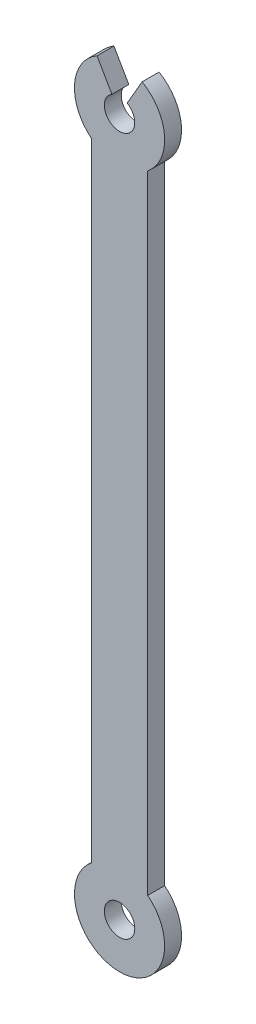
ISO-10303-21;
HEADER;
FILE_DESCRIPTION(('STEP AP214'),'2;1');
FILE_NAME('part.step','',(''),(''),'','','');
FILE_SCHEMA(('AUTOMOTIVE_DESIGN { 1 0 10303 214 1 1 1 1 }'));
ENDSEC;
DATA;
#1=APPLICATION_CONTEXT('core data for automotive mechanical design processes');
#2=APPLICATION_PROTOCOL_DEFINITION('international standard','automotive_design',2000,#1);
#3=PRODUCT_CONTEXT('',#1,'mechanical');
#4=PRODUCT('Part','Part','',(#3));
#5=PRODUCT_RELATED_PRODUCT_CATEGORY('part','',(#4));
#6=PRODUCT_DEFINITION_FORMATION('','',#4);
#7=PRODUCT_DEFINITION_CONTEXT('part definition',#1,'design');
#8=PRODUCT_DEFINITION('design','',#6,#7);
#9=PRODUCT_DEFINITION_SHAPE('','',#8);
#10=(LENGTH_UNIT() NAMED_UNIT(*) SI_UNIT(.MILLI.,.METRE.));
#11=(NAMED_UNIT(*) PLANE_ANGLE_UNIT() SI_UNIT($,.RADIAN.));
#12=(NAMED_UNIT(*) SI_UNIT($,.STERADIAN.) SOLID_ANGLE_UNIT());
#13=UNCERTAINTY_MEASURE_WITH_UNIT(LENGTH_MEASURE(1.E-05),#10,'distance_accuracy_value','');
#14=(GEOMETRIC_REPRESENTATION_CONTEXT(3) GLOBAL_UNCERTAINTY_ASSIGNED_CONTEXT((#13)) GLOBAL_UNIT_ASSIGNED_CONTEXT((#10,
#11,#12)) REPRESENTATION_CONTEXT('',''));
#15=CARTESIAN_POINT('',(0.,0.,0.));
#16=DIRECTION('',(0.,0.,1.));
#17=DIRECTION('',(1.,0.,0.));
#18=AXIS2_PLACEMENT_3D('',#15,#16,#17);
#19=CARTESIAN_POINT('',(0.,0.,1.5));
#20=DIRECTION('',(-0.866025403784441,-0.499999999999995,0.));
#21=DIRECTION('',(0.499999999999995,-0.866025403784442,0.));
#22=AXIS2_PLACEMENT_3D('',#19,#20,#21);
#23=PLANE('',#22);
#24=DIRECTION('',(-0.499999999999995,0.866025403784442,0.));
#25=VECTOR('',#24,1.);
#26=CARTESIAN_POINT('',(0.,0.,0.));
#27=LINE('',#26,#25);
#28=CARTESIAN_POINT('',(-0.674999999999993,1.169134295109,0.));
#29=VERTEX_POINT('',#28);
#30=CARTESIAN_POINT('',(-1.99999999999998,3.46410161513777,0.));
#31=VERTEX_POINT('',#30);
#32=EDGE_CURVE('E147',#29,#31,#27,.T.);
#33=ORIENTED_EDGE('',*,*,#32,.T.);
#34=DIRECTION('',(0.,0.,-1.));
#35=VECTOR('',#34,1.);
#36=CARTESIAN_POINT('',(-1.99999999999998,3.46410161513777,1.5));
#37=LINE('',#36,#35);
#38=CARTESIAN_POINT('',(-1.99999999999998,3.46410161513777,1.5));
#39=VERTEX_POINT('',#38);
#40=EDGE_CURVE('E11',#39,#31,#37,.T.);
#41=ORIENTED_EDGE('',*,*,#40,.F.);
#42=DIRECTION('',(-0.499999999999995,0.866025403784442,0.));
#43=VECTOR('',#42,1.);
#44=CARTESIAN_POINT('',(0.,0.,1.5));
#45=LINE('',#44,#43);
#46=CARTESIAN_POINT('',(-0.674999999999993,1.169134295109,1.5));
#47=VERTEX_POINT('',#46);
#48=EDGE_CURVE('E210',#47,#39,#45,.T.);
#49=ORIENTED_EDGE('',*,*,#48,.F.);
#50=DIRECTION('',(0.,0.,-1.));
#51=VECTOR('',#50,1.);
#52=CARTESIAN_POINT('',(-0.674999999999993,1.169134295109,1.5));
#53=LINE('',#52,#51);
#54=EDGE_CURVE('E59',#47,#29,#53,.T.);
#55=ORIENTED_EDGE('',*,*,#54,.T.);
#56=EDGE_LOOP('',(#33,#41,#49,#55));
#57=FACE_BOUND('',#56,.T.);
#58=ADVANCED_FACE('F41',(#57),#23,.F.);
#59=CARTESIAN_POINT('',(0.,0.,1.5));
#60=DIRECTION('',(0.,0.,-1.));
#61=DIRECTION('',(-1.,0.,0.));
#62=AXIS2_PLACEMENT_3D('',#59,#60,#61);
#63=CYLINDRICAL_SURFACE('',#62,4.);
#64=CARTESIAN_POINT('',(0.,0.,0.));
#65=DIRECTION('',(0.,0.,1.));
#66=DIRECTION('',(1.,0.,0.));
#67=AXIS2_PLACEMENT_3D('',#64,#65,#66);
#68=CIRCLE('',#67,4.);
#69=CARTESIAN_POINT('',(-2.5,-3.1224989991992,0.));
#70=VERTEX_POINT('',#69);
#71=EDGE_CURVE('E150',#31,#70,#68,.T.);
#72=ORIENTED_EDGE('',*,*,#71,.T.);
#73=DIRECTION('',(0.,0.,-1.));
#74=VECTOR('',#73,1.);
#75=CARTESIAN_POINT('',(-2.5,-3.1224989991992,1.5));
#76=LINE('',#75,#74);
#77=CARTESIAN_POINT('',(-2.5,-3.1224989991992,1.5));
#78=VERTEX_POINT('',#77);
#79=EDGE_CURVE('E51',#78,#70,#76,.T.);
#80=ORIENTED_EDGE('',*,*,#79,.F.);
#81=CARTESIAN_POINT('',(0.,0.,1.5));
#82=DIRECTION('',(0.,0.,1.));
#83=DIRECTION('',(1.,0.,0.));
#84=AXIS2_PLACEMENT_3D('',#81,#82,#83);
#85=CIRCLE('',#84,4.);
#86=EDGE_CURVE('E97',#39,#78,#85,.T.);
#87=ORIENTED_EDGE('',*,*,#86,.F.);
#88=ORIENTED_EDGE('',*,*,#40,.T.);
#89=EDGE_LOOP('',(#72,#80,#87,#88));
#90=FACE_BOUND('',#89,.T.);
#91=ADVANCED_FACE('F194',(#90),#63,.T.);
#92=CARTESIAN_POINT('',(-2.5,0.,1.5));
#93=DIRECTION('',(-1.,0.,0.));
#94=DIRECTION('',(0.,-1.,0.));
#95=AXIS2_PLACEMENT_3D('',#92,#93,#94);
#96=PLANE('',#95);
#97=DIRECTION('',(0.,1.,0.));
#98=VECTOR('',#97,1.);
#99=CARTESIAN_POINT('',(-2.5,0.,0.));
#100=LINE('',#99,#98);
#101=CARTESIAN_POINT('',(-2.5,-58.7775010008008,0.));
#102=VERTEX_POINT('',#101);
#103=EDGE_CURVE('E154',#102,#70,#100,.T.);
#104=ORIENTED_EDGE('',*,*,#103,.F.);
#105=DIRECTION('',(0.,0.,-1.));
#106=VECTOR('',#105,1.);
#107=CARTESIAN_POINT('',(-2.5,-58.7775010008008,1.5));
#108=LINE('',#107,#106);
#109=CARTESIAN_POINT('',(-2.5,-58.7775010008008,1.5));
#110=VERTEX_POINT('',#109);
#111=EDGE_CURVE('E185',#110,#102,#108,.T.);
#112=ORIENTED_EDGE('',*,*,#111,.F.);
#113=DIRECTION('',(0.,1.,0.));
#114=VECTOR('',#113,1.);
#115=CARTESIAN_POINT('',(-2.5,0.,1.5));
#116=LINE('',#115,#114);
#117=EDGE_CURVE('E193',#110,#78,#116,.T.);
#118=ORIENTED_EDGE('',*,*,#117,.T.);
#119=ORIENTED_EDGE('',*,*,#79,.T.);
#120=EDGE_LOOP('',(#104,#112,#118,#119));
#121=FACE_BOUND('',#120,.T.);
#122=ADVANCED_FACE('F191',(#121),#96,.T.);
#123=CARTESIAN_POINT('',(0.,-61.9,1.5));
#124=DIRECTION('',(0.,0.,-1.));
#125=DIRECTION('',(-1.,0.,0.));
#126=AXIS2_PLACEMENT_3D('',#123,#124,#125);
#127=CYLINDRICAL_SURFACE('',#126,4.);
#128=CARTESIAN_POINT('',(0.,-61.9,0.));
#129=DIRECTION('',(0.,0.,1.));
#130=DIRECTION('',(1.,0.,0.));
#131=AXIS2_PLACEMENT_3D('',#128,#129,#130);
#132=CIRCLE('',#131,4.);
#133=CARTESIAN_POINT('',(2.50000000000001,-58.7775010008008,0.));
#134=VERTEX_POINT('',#133);
#135=EDGE_CURVE('E158',#102,#134,#132,.T.);
#136=ORIENTED_EDGE('',*,*,#135,.T.);
#137=DIRECTION('',(0.,0.,-1.));
#138=VECTOR('',#137,1.);
#139=CARTESIAN_POINT('',(2.50000000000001,-58.7775010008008,1.5));
#140=LINE('',#139,#138);
#141=CARTESIAN_POINT('',(2.50000000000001,-58.7775010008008,1.5));
#142=VERTEX_POINT('',#141);
#143=EDGE_CURVE('E182',#142,#134,#140,.T.);
#144=ORIENTED_EDGE('',*,*,#143,.F.);
#145=CARTESIAN_POINT('',(0.,-61.9,1.5));
#146=DIRECTION('',(0.,0.,1.));
#147=DIRECTION('',(1.,0.,0.));
#148=AXIS2_PLACEMENT_3D('',#145,#146,#147);
#149=CIRCLE('',#148,4.);
#150=EDGE_CURVE('E204',#110,#142,#149,.T.);
#151=ORIENTED_EDGE('',*,*,#150,.F.);
#152=ORIENTED_EDGE('',*,*,#111,.T.);
#153=EDGE_LOOP('',(#136,#144,#151,#152));
#154=FACE_BOUND('',#153,.T.);
#155=ADVANCED_FACE('F202',(#154),#127,.T.);
#156=CARTESIAN_POINT('',(2.5,0.,1.5));
#157=DIRECTION('',(1.,0.,0.));
#158=DIRECTION('',(0.,1.,0.));
#159=AXIS2_PLACEMENT_3D('',#156,#157,#158);
#160=PLANE('',#159);
#161=DIRECTION('',(0.,-1.,0.));
#162=VECTOR('',#161,1.);
#163=CARTESIAN_POINT('',(2.5,0.,0.));
#164=LINE('',#163,#162);
#165=CARTESIAN_POINT('',(2.5,-3.1224989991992,0.));
#166=VERTEX_POINT('',#165);
#167=EDGE_CURVE('E162',#166,#134,#164,.T.);
#168=ORIENTED_EDGE('',*,*,#167,.F.);
#169=DIRECTION('',(0.,0.,-1.));
#170=VECTOR('',#169,1.);
#171=CARTESIAN_POINT('',(2.5,-3.1224989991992,1.5));
#172=LINE('',#171,#170);
#173=CARTESIAN_POINT('',(2.5,-3.1224989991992,1.5));
#174=VERTEX_POINT('',#173);
#175=EDGE_CURVE('E133',#174,#166,#172,.T.);
#176=ORIENTED_EDGE('',*,*,#175,.F.);
#177=DIRECTION('',(0.,-1.,0.));
#178=VECTOR('',#177,1.);
#179=CARTESIAN_POINT('',(2.5,0.,1.5));
#180=LINE('',#179,#178);
#181=EDGE_CURVE('E121',#174,#142,#180,.T.);
#182=ORIENTED_EDGE('',*,*,#181,.T.);
#183=ORIENTED_EDGE('',*,*,#143,.T.);
#184=EDGE_LOOP('',(#168,#176,#182,#183));
#185=FACE_BOUND('',#184,.T.);
#186=ADVANCED_FACE('F215',(#185),#160,.T.);
#187=CARTESIAN_POINT('',(0.,0.,1.5));
#188=DIRECTION('',(0.,0.,-1.));
#189=DIRECTION('',(-1.,0.,0.));
#190=AXIS2_PLACEMENT_3D('',#187,#188,#189);
#191=CYLINDRICAL_SURFACE('',#190,4.);
#192=CARTESIAN_POINT('',(0.,0.,0.));
#193=DIRECTION('',(0.,0.,1.));
#194=DIRECTION('',(1.,0.,0.));
#195=AXIS2_PLACEMENT_3D('',#192,#193,#194);
#196=CIRCLE('',#195,4.);
#197=CARTESIAN_POINT('',(1.99999999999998,3.46410161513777,0.));
#198=VERTEX_POINT('',#197);
#199=EDGE_CURVE('E129',#166,#198,#196,.T.);
#200=ORIENTED_EDGE('',*,*,#199,.T.);
#201=DIRECTION('',(0.,0.,-1.));
#202=VECTOR('',#201,1.);
#203=CARTESIAN_POINT('',(1.99999999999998,3.46410161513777,1.5));
#204=LINE('',#203,#202);
#205=CARTESIAN_POINT('',(1.99999999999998,3.46410161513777,1.5));
#206=VERTEX_POINT('',#205);
#207=EDGE_CURVE('E126',#206,#198,#204,.T.);
#208=ORIENTED_EDGE('',*,*,#207,.F.);
#209=CARTESIAN_POINT('',(0.,0.,1.5));
#210=DIRECTION('',(0.,0.,1.));
#211=DIRECTION('',(1.,0.,0.));
#212=AXIS2_PLACEMENT_3D('',#209,#210,#211);
#213=CIRCLE('',#212,4.);
#214=EDGE_CURVE('E114',#174,#206,#213,.T.);
#215=ORIENTED_EDGE('',*,*,#214,.F.);
#216=ORIENTED_EDGE('',*,*,#175,.T.);
#217=EDGE_LOOP('',(#200,#208,#215,#216));
#218=FACE_BOUND('',#217,.T.);
#219=ADVANCED_FACE('F127',(#218),#191,.T.);
#220=CARTESIAN_POINT('',(0.,0.,1.5));
#221=DIRECTION('',(-0.866025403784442,0.499999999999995,0.));
#222=DIRECTION('',(-0.499999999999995,-0.866025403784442,0.));
#223=AXIS2_PLACEMENT_3D('',#220,#221,#222);
#224=PLANE('',#223);
#225=DIRECTION('',(0.499999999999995,0.866025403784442,0.));
#226=VECTOR('',#225,1.);
#227=CARTESIAN_POINT('',(0.,0.,0.));
#228=LINE('',#227,#226);
#229=CARTESIAN_POINT('',(0.674999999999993,1.169134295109,0.));
#230=VERTEX_POINT('',#229);
#231=EDGE_CURVE('E168',#230,#198,#228,.T.);
#232=ORIENTED_EDGE('',*,*,#231,.F.);
#233=DIRECTION('',(0.,0.,-1.));
#234=VECTOR('',#233,1.);
#235=CARTESIAN_POINT('',(0.674999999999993,1.169134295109,1.5));
#236=LINE('',#235,#234);
#237=CARTESIAN_POINT('',(0.674999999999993,1.169134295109,1.5));
#238=VERTEX_POINT('',#237);
#239=EDGE_CURVE('E85',#238,#230,#236,.T.);
#240=ORIENTED_EDGE('',*,*,#239,.F.);
#241=DIRECTION('',(0.499999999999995,0.866025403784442,0.));
#242=VECTOR('',#241,1.);
#243=CARTESIAN_POINT('',(0.,0.,1.5));
#244=LINE('',#243,#242);
#245=EDGE_CURVE('E119',#238,#206,#244,.T.);
#246=ORIENTED_EDGE('',*,*,#245,.T.);
#247=ORIENTED_EDGE('',*,*,#207,.T.);
#248=EDGE_LOOP('',(#232,#240,#246,#247));
#249=FACE_BOUND('',#248,.T.);
#250=ADVANCED_FACE('F135',(#249),#224,.T.);
#251=CARTESIAN_POINT('',(0.,-61.9,1.5));
#252=DIRECTION('',(0.,0.,-1.));
#253=DIRECTION('',(-1.,0.,0.));
#254=AXIS2_PLACEMENT_3D('',#251,#252,#253);
#255=CYLINDRICAL_SURFACE('',#254,1.35);
#256=CARTESIAN_POINT('',(0.,-61.9,1.5));
#257=DIRECTION('',(0.,0.,1.));
#258=DIRECTION('',(1.,0.,0.));
#259=AXIS2_PLACEMENT_3D('',#256,#257,#258);
#260=CIRCLE('',#259,1.35);
#261=CARTESIAN_POINT('',(1.35000000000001,-61.9,1.5));
#262=VERTEX_POINT('',#261);
#263=EDGE_CURVE('E175',#262,#262,#260,.T.);
#264=ORIENTED_EDGE('',*,*,#263,.T.);
#265=EDGE_LOOP('',(#264));
#266=FACE_BOUND('',#265,.T.);
#267=CARTESIAN_POINT('',(0.,-61.9,0.));
#268=DIRECTION('',(0.,0.,1.));
#269=DIRECTION('',(1.,0.,0.));
#270=AXIS2_PLACEMENT_3D('',#267,#268,#269);
#271=CIRCLE('',#270,1.35);
#272=CARTESIAN_POINT('',(1.35000000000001,-61.9,0.));
#273=VERTEX_POINT('',#272);
#274=EDGE_CURVE('E143',#273,#273,#271,.T.);
#275=ORIENTED_EDGE('',*,*,#274,.F.);
#276=EDGE_LOOP('',(#275));
#277=FACE_BOUND('',#276,.T.);
#278=ADVANCED_FACE('F43',(#266,#277),#255,.F.);
#279=CARTESIAN_POINT('',(0.,0.,1.5));
#280=DIRECTION('',(0.,0.,-1.));
#281=DIRECTION('',(-1.,0.,0.));
#282=AXIS2_PLACEMENT_3D('',#279,#280,#281);
#283=CYLINDRICAL_SURFACE('',#282,1.35);
#284=CARTESIAN_POINT('',(0.,0.,0.));
#285=DIRECTION('',(0.,0.,1.));
#286=DIRECTION('',(1.,0.,0.));
#287=AXIS2_PLACEMENT_3D('',#284,#285,#286);
#288=CIRCLE('',#287,1.35);
#289=EDGE_CURVE('E171',#29,#230,#288,.T.);
#290=ORIENTED_EDGE('',*,*,#289,.F.);
#291=ORIENTED_EDGE('',*,*,#54,.F.);
#292=CARTESIAN_POINT('',(0.,0.,1.5));
#293=DIRECTION('',(0.,0.,1.));
#294=DIRECTION('',(1.,0.,0.));
#295=AXIS2_PLACEMENT_3D('',#292,#293,#294);
#296=CIRCLE('',#295,1.35);
#297=EDGE_CURVE('E137',#47,#238,#296,.T.);
#298=ORIENTED_EDGE('',*,*,#297,.T.);
#299=ORIENTED_EDGE('',*,*,#239,.T.);
#300=EDGE_LOOP('',(#290,#291,#298,#299));
#301=FACE_BOUND('',#300,.T.);
#302=ADVANCED_FACE('F216',(#301),#283,.F.);
#303=CARTESIAN_POINT('',(0.,0.,1.5));
#304=DIRECTION('',(0.,0.,1.));
#305=DIRECTION('',(1.,0.,0.));
#306=AXIS2_PLACEMENT_3D('',#303,#304,#305);
#307=PLANE('',#306);
#308=ORIENTED_EDGE('',*,*,#263,.F.);
#309=EDGE_LOOP('',(#308));
#310=FACE_BOUND('',#309,.T.);
#311=ORIENTED_EDGE('',*,*,#48,.T.);
#312=ORIENTED_EDGE('',*,*,#86,.T.);
#313=ORIENTED_EDGE('',*,*,#117,.F.);
#314=ORIENTED_EDGE('',*,*,#150,.T.);
#315=ORIENTED_EDGE('',*,*,#181,.F.);
#316=ORIENTED_EDGE('',*,*,#214,.T.);
#317=ORIENTED_EDGE('',*,*,#245,.F.);
#318=ORIENTED_EDGE('',*,*,#297,.F.);
#319=EDGE_LOOP('',(#311,#312,#313,#314,#315,#316,#317,#318));
#320=FACE_BOUND('',#319,.T.);
#321=ADVANCED_FACE('F116',(#310,#320),#307,.T.);
#322=CARTESIAN_POINT('',(0.,0.,0.));
#323=DIRECTION('',(0.,0.,1.));
#324=DIRECTION('',(1.,0.,0.));
#325=AXIS2_PLACEMENT_3D('',#322,#323,#324);
#326=PLANE('',#325);
#327=ORIENTED_EDGE('',*,*,#274,.T.);
#328=EDGE_LOOP('',(#327));
#329=FACE_BOUND('',#328,.T.);
#330=ORIENTED_EDGE('',*,*,#32,.F.);
#331=ORIENTED_EDGE('',*,*,#289,.T.);
#332=ORIENTED_EDGE('',*,*,#231,.T.);
#333=ORIENTED_EDGE('',*,*,#199,.F.);
#334=ORIENTED_EDGE('',*,*,#167,.T.);
#335=ORIENTED_EDGE('',*,*,#135,.F.);
#336=ORIENTED_EDGE('',*,*,#103,.T.);
#337=ORIENTED_EDGE('',*,*,#71,.F.);
#338=EDGE_LOOP('',(#330,#331,#332,#333,#334,#335,#336,#337));
#339=FACE_BOUND('',#338,.T.);
#340=ADVANCED_FACE('F198',(#329,#339),#326,.F.);
#341=CLOSED_SHELL('',(#58,#91,#122,#155,#186,#219,#250,#278,#302,#321,#340));
#342=MANIFOLD_SOLID_BREP('B2',#341);
#343=ADVANCED_BREP_SHAPE_REPRESENTATION('',(#18,#342),#14);
#344=SHAPE_DEFINITION_REPRESENTATION(#9,#343);
ENDSEC;
END-ISO-10303-21;
